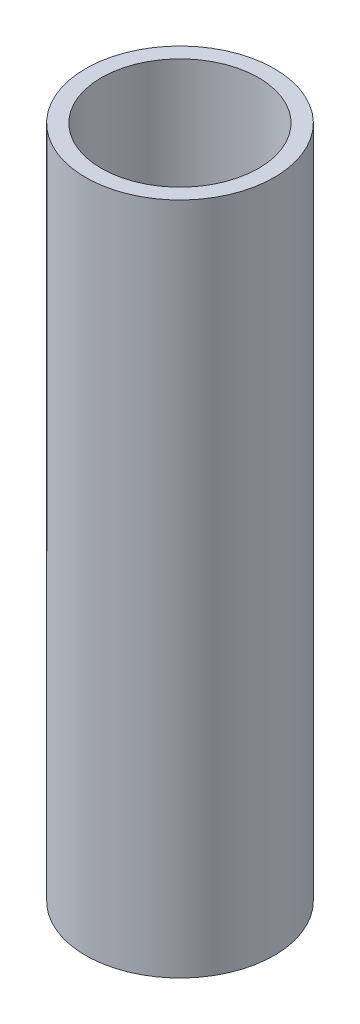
ISO-10303-21;
HEADER;
FILE_DESCRIPTION(('STEP AP214'),'2;1');
FILE_NAME('part.step','',(''),(''),'','','');
FILE_SCHEMA(('AUTOMOTIVE_DESIGN { 1 0 10303 214 1 1 1 1 }'));
ENDSEC;
DATA;
#1=APPLICATION_CONTEXT('core data for automotive mechanical design processes');
#2=APPLICATION_PROTOCOL_DEFINITION('international standard','automotive_design',2000,#1);
#3=PRODUCT_CONTEXT('',#1,'mechanical');
#4=PRODUCT('Part','Part','',(#3));
#5=PRODUCT_RELATED_PRODUCT_CATEGORY('part','',(#4));
#6=PRODUCT_DEFINITION_FORMATION('','',#4);
#7=PRODUCT_DEFINITION_CONTEXT('part definition',#1,'design');
#8=PRODUCT_DEFINITION('design','',#6,#7);
#9=PRODUCT_DEFINITION_SHAPE('','',#8);
#10=(LENGTH_UNIT() NAMED_UNIT(*) SI_UNIT(.MILLI.,.METRE.));
#11=(NAMED_UNIT(*) PLANE_ANGLE_UNIT() SI_UNIT($,.RADIAN.));
#12=(NAMED_UNIT(*) SI_UNIT($,.STERADIAN.) SOLID_ANGLE_UNIT());
#13=UNCERTAINTY_MEASURE_WITH_UNIT(LENGTH_MEASURE(1.E-05),#10,'distance_accuracy_value','');
#14=(GEOMETRIC_REPRESENTATION_CONTEXT(3) GLOBAL_UNCERTAINTY_ASSIGNED_CONTEXT((#13)) GLOBAL_UNIT_ASSIGNED_CONTEXT((#10,
#11,#12)) REPRESENTATION_CONTEXT('',''));
#15=CARTESIAN_POINT('',(0.,0.,0.));
#16=DIRECTION('',(0.,0.,1.));
#17=DIRECTION('',(1.,0.,0.));
#18=AXIS2_PLACEMENT_3D('',#15,#16,#17);
#19=CARTESIAN_POINT('',(0.,90.,0.));
#20=DIRECTION('',(0.,1.,0.));
#21=DIRECTION('',(0.,0.,1.));
#22=AXIS2_PLACEMENT_3D('',#19,#20,#21);
#23=PLANE('',#22);
#24=CARTESIAN_POINT('',(0.,90.,0.));
#25=DIRECTION('',(0.,1.,0.));
#26=DIRECTION('',(0.,0.,1.));
#27=AXIS2_PLACEMENT_3D('',#24,#25,#26);
#28=CIRCLE('',#27,12.6);
#29=CARTESIAN_POINT('',(0.,90.,-12.6));
#30=VERTEX_POINT('',#29);
#31=EDGE_CURVE('E10',#30,#30,#28,.T.);
#32=ORIENTED_EDGE('',*,*,#31,.T.);
#33=EDGE_LOOP('',(#32));
#34=FACE_BOUND('',#33,.T.);
#35=CARTESIAN_POINT('',(0.,90.,0.));
#36=DIRECTION('',(0.,1.,0.));
#37=DIRECTION('',(0.,0.,1.));
#38=AXIS2_PLACEMENT_3D('',#35,#36,#37);
#39=CIRCLE('',#38,10.5);
#40=CARTESIAN_POINT('',(0.,90.,-10.5));
#41=VERTEX_POINT('',#40);
#42=EDGE_CURVE('E42',#41,#41,#39,.T.);
#43=ORIENTED_EDGE('',*,*,#42,.F.);
#44=EDGE_LOOP('',(#43));
#45=FACE_BOUND('',#44,.T.);
#46=ADVANCED_FACE('F31',(#34,#45),#23,.T.);
#47=CARTESIAN_POINT('',(0.,0.,0.));
#48=DIRECTION('',(0.,1.,0.));
#49=DIRECTION('',(0.,0.,1.));
#50=AXIS2_PLACEMENT_3D('',#47,#48,#49);
#51=PLANE('',#50);
#52=CARTESIAN_POINT('',(0.,0.,0.));
#53=DIRECTION('',(0.,1.,0.));
#54=DIRECTION('',(0.,0.,1.));
#55=AXIS2_PLACEMENT_3D('',#52,#53,#54);
#56=CIRCLE('',#55,12.6);
#57=CARTESIAN_POINT('',(0.,0.,-12.6));
#58=VERTEX_POINT('',#57);
#59=EDGE_CURVE('E35',#58,#58,#56,.T.);
#60=ORIENTED_EDGE('',*,*,#59,.F.);
#61=EDGE_LOOP('',(#60));
#62=FACE_BOUND('',#61,.T.);
#63=CARTESIAN_POINT('',(0.,0.,0.));
#64=DIRECTION('',(0.,1.,0.));
#65=DIRECTION('',(0.,0.,1.));
#66=AXIS2_PLACEMENT_3D('',#63,#64,#65);
#67=CIRCLE('',#66,10.5);
#68=CARTESIAN_POINT('',(0.,0.,-10.5));
#69=VERTEX_POINT('',#68);
#70=EDGE_CURVE('E44',#69,#69,#67,.T.);
#71=ORIENTED_EDGE('',*,*,#70,.T.);
#72=EDGE_LOOP('',(#71));
#73=FACE_BOUND('',#72,.T.);
#74=ADVANCED_FACE('F54',(#62,#73),#51,.F.);
#75=CARTESIAN_POINT('',(0.,90.,0.));
#76=DIRECTION('',(0.,-1.,0.));
#77=DIRECTION('',(0.,0.,-1.));
#78=AXIS2_PLACEMENT_3D('',#75,#76,#77);
#79=CYLINDRICAL_SURFACE('',#78,12.6);
#80=CARTESIAN_POINT('',(0.,90.,-12.6));
#81=CARTESIAN_POINT('',(0.,89.0625,-12.6));
#82=CARTESIAN_POINT('',(0.,88.125,-12.6));
#83=CARTESIAN_POINT('',(0.,86.25,-12.6));
#84=CARTESIAN_POINT('',(0.,85.3125,-12.6));
#85=CARTESIAN_POINT('',(0.,83.4375,-12.6));
#86=CARTESIAN_POINT('',(0.,82.5,-12.6));
#87=CARTESIAN_POINT('',(0.,80.625,-12.6));
#88=CARTESIAN_POINT('',(0.,79.6875,-12.6));
#89=CARTESIAN_POINT('',(0.,77.8125,-12.6));
#90=CARTESIAN_POINT('',(0.,76.875,-12.6));
#91=CARTESIAN_POINT('',(0.,75.,-12.6));
#92=CARTESIAN_POINT('',(0.,74.0625,-12.6));
#93=CARTESIAN_POINT('',(0.,72.1875,-12.6));
#94=CARTESIAN_POINT('',(0.,71.25,-12.6));
#95=CARTESIAN_POINT('',(0.,69.375,-12.6));
#96=CARTESIAN_POINT('',(0.,68.4375,-12.6));
#97=CARTESIAN_POINT('',(0.,66.5625,-12.6));
#98=CARTESIAN_POINT('',(0.,65.625,-12.6));
#99=CARTESIAN_POINT('',(0.,63.75,-12.6));
#100=CARTESIAN_POINT('',(0.,62.8125,-12.6));
#101=CARTESIAN_POINT('',(0.,60.9375,-12.6));
#102=CARTESIAN_POINT('',(0.,60.,-12.6));
#103=CARTESIAN_POINT('',(0.,58.125,-12.6));
#104=CARTESIAN_POINT('',(0.,57.1875,-12.6));
#105=CARTESIAN_POINT('',(0.,55.3125,-12.6));
#106=CARTESIAN_POINT('',(0.,54.375,-12.6));
#107=CARTESIAN_POINT('',(0.,52.5,-12.6));
#108=CARTESIAN_POINT('',(0.,51.5625,-12.6));
#109=CARTESIAN_POINT('',(0.,49.6875,-12.6));
#110=CARTESIAN_POINT('',(0.,48.75,-12.6));
#111=CARTESIAN_POINT('',(0.,46.875,-12.6));
#112=CARTESIAN_POINT('',(0.,45.9375,-12.6));
#113=CARTESIAN_POINT('',(0.,44.0625,-12.6));
#114=CARTESIAN_POINT('',(0.,43.125,-12.6));
#115=CARTESIAN_POINT('',(0.,41.25,-12.6));
#116=CARTESIAN_POINT('',(0.,40.3125,-12.6));
#117=CARTESIAN_POINT('',(0.,38.4375,-12.6));
#118=CARTESIAN_POINT('',(0.,37.5,-12.6));
#119=CARTESIAN_POINT('',(0.,35.625,-12.6));
#120=CARTESIAN_POINT('',(0.,34.6875,-12.6));
#121=CARTESIAN_POINT('',(0.,32.8125,-12.6));
#122=CARTESIAN_POINT('',(0.,31.875,-12.6));
#123=CARTESIAN_POINT('',(0.,30.,-12.6));
#124=CARTESIAN_POINT('',(0.,29.0625,-12.6));
#125=CARTESIAN_POINT('',(0.,27.1875,-12.6));
#126=CARTESIAN_POINT('',(0.,26.25,-12.6));
#127=CARTESIAN_POINT('',(0.,24.375,-12.6));
#128=CARTESIAN_POINT('',(0.,23.4375,-12.6));
#129=CARTESIAN_POINT('',(0.,21.5625,-12.6));
#130=CARTESIAN_POINT('',(0.,20.625,-12.6));
#131=CARTESIAN_POINT('',(0.,18.75,-12.6));
#132=CARTESIAN_POINT('',(0.,17.8125,-12.6));
#133=CARTESIAN_POINT('',(0.,15.9375,-12.6));
#134=CARTESIAN_POINT('',(0.,15.,-12.6));
#135=CARTESIAN_POINT('',(0.,13.125,-12.6));
#136=CARTESIAN_POINT('',(0.,12.1875,-12.6));
#137=CARTESIAN_POINT('',(0.,10.3125,-12.6));
#138=CARTESIAN_POINT('',(0.,9.37499999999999,-12.6));
#139=CARTESIAN_POINT('',(0.,7.49999999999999,-12.6));
#140=CARTESIAN_POINT('',(0.,6.56249999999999,-12.6));
#141=CARTESIAN_POINT('',(0.,4.68749999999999,-12.6));
#142=CARTESIAN_POINT('',(0.,3.74999999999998,-12.6));
#143=CARTESIAN_POINT('',(0.,1.87499999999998,-12.6));
#144=CARTESIAN_POINT('',(0.,0.937499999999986,-12.6));
#145=CARTESIAN_POINT('',(0.,0.,-12.6));
#146=B_SPLINE_CURVE_WITH_KNOTS('',3,(#80,#81,#82,#83,#84,#85,#86,#87,#88,#89,#90,#91,#92,#93,
#94,#95,#96,#97,#98,#99,#100,#101,#102,#103,#104,#105,#106,#107,#108,#109,#110,#111,#112,#113,
#114,#115,#116,#117,#118,#119,#120,#121,#122,#123,#124,#125,#126,#127,#128,#129,#130,#131,#132,
#133,#134,#135,#136,#137,#138,#139,#140,#141,#142,#143,#144,#145),.UNSPECIFIED.,.F.,.F.,(4,2,2,
2,2,2,2,2,2,2,2,2,2,2,2,2,2,2,2,2,2,2,2,2,2,2,2,2,2,2,2,2,4),(0.,2.8125,5.62499999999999,
8.43749999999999,11.25,14.0625,16.875,19.6875,22.5,25.3125,28.125,30.9375,33.75,36.5625,39.375,
42.1875,45.,47.8125,50.625,53.4375,56.25,59.0625,61.875,64.6875,67.5,70.3125,73.125,75.9375,
78.75,81.5625,84.375,87.1875,90.),.UNSPECIFIED.);
#147=EDGE_CURVE('BSEAM33',#30,#58,#146,.T.);
#148=ORIENTED_EDGE('',*,*,#31,.F.);
#149=ORIENTED_EDGE('',*,*,#59,.T.);
#150=ORIENTED_EDGE('',*,*,#147,.T.);
#151=ORIENTED_EDGE('',*,*,#147,.F.);
#152=EDGE_LOOP('',(#148,#150,#149,#151));
#153=FACE_BOUND('',#152,.T.);
#154=ADVANCED_FACE('F33',(#153),#79,.T.);
#155=CARTESIAN_POINT('',(0.,90.,0.));
#156=DIRECTION('',(0.,-1.,0.));
#157=DIRECTION('',(0.,0.,-1.));
#158=AXIS2_PLACEMENT_3D('',#155,#156,#157);
#159=CYLINDRICAL_SURFACE('',#158,10.5);
#160=CARTESIAN_POINT('',(0.,90.,-10.5));
#161=CARTESIAN_POINT('',(0.,89.0625,-10.5));
#162=CARTESIAN_POINT('',(0.,88.125,-10.5));
#163=CARTESIAN_POINT('',(0.,86.25,-10.5));
#164=CARTESIAN_POINT('',(0.,85.3125,-10.5));
#165=CARTESIAN_POINT('',(0.,83.4375,-10.5));
#166=CARTESIAN_POINT('',(0.,82.5,-10.5));
#167=CARTESIAN_POINT('',(0.,80.625,-10.5));
#168=CARTESIAN_POINT('',(0.,79.6875,-10.5));
#169=CARTESIAN_POINT('',(0.,77.8125,-10.5));
#170=CARTESIAN_POINT('',(0.,76.875,-10.5));
#171=CARTESIAN_POINT('',(0.,75.,-10.5));
#172=CARTESIAN_POINT('',(0.,74.0625,-10.5));
#173=CARTESIAN_POINT('',(0.,72.1875,-10.5));
#174=CARTESIAN_POINT('',(0.,71.25,-10.5));
#175=CARTESIAN_POINT('',(0.,69.375,-10.5));
#176=CARTESIAN_POINT('',(0.,68.4375,-10.5));
#177=CARTESIAN_POINT('',(0.,66.5625,-10.5));
#178=CARTESIAN_POINT('',(0.,65.625,-10.5));
#179=CARTESIAN_POINT('',(0.,63.75,-10.5));
#180=CARTESIAN_POINT('',(0.,62.8125,-10.5));
#181=CARTESIAN_POINT('',(0.,60.9375,-10.5));
#182=CARTESIAN_POINT('',(0.,60.,-10.5));
#183=CARTESIAN_POINT('',(0.,58.125,-10.5));
#184=CARTESIAN_POINT('',(0.,57.1875,-10.5));
#185=CARTESIAN_POINT('',(0.,55.3125,-10.5));
#186=CARTESIAN_POINT('',(0.,54.375,-10.5));
#187=CARTESIAN_POINT('',(0.,52.5,-10.5));
#188=CARTESIAN_POINT('',(0.,51.5625,-10.5));
#189=CARTESIAN_POINT('',(0.,49.6875,-10.5));
#190=CARTESIAN_POINT('',(0.,48.75,-10.5));
#191=CARTESIAN_POINT('',(0.,46.875,-10.5));
#192=CARTESIAN_POINT('',(0.,45.9375,-10.5));
#193=CARTESIAN_POINT('',(0.,44.0625,-10.5));
#194=CARTESIAN_POINT('',(0.,43.125,-10.5));
#195=CARTESIAN_POINT('',(0.,41.25,-10.5));
#196=CARTESIAN_POINT('',(0.,40.3125,-10.5));
#197=CARTESIAN_POINT('',(0.,38.4375,-10.5));
#198=CARTESIAN_POINT('',(0.,37.5,-10.5));
#199=CARTESIAN_POINT('',(0.,35.625,-10.5));
#200=CARTESIAN_POINT('',(0.,34.6875,-10.5));
#201=CARTESIAN_POINT('',(0.,32.8125,-10.5));
#202=CARTESIAN_POINT('',(0.,31.875,-10.5));
#203=CARTESIAN_POINT('',(0.,30.,-10.5));
#204=CARTESIAN_POINT('',(0.,29.0625,-10.5));
#205=CARTESIAN_POINT('',(0.,27.1875,-10.5));
#206=CARTESIAN_POINT('',(0.,26.25,-10.5));
#207=CARTESIAN_POINT('',(0.,24.375,-10.5));
#208=CARTESIAN_POINT('',(0.,23.4375,-10.5));
#209=CARTESIAN_POINT('',(0.,21.5625,-10.5));
#210=CARTESIAN_POINT('',(0.,20.625,-10.5));
#211=CARTESIAN_POINT('',(0.,18.75,-10.5));
#212=CARTESIAN_POINT('',(0.,17.8125,-10.5));
#213=CARTESIAN_POINT('',(0.,15.9375,-10.5));
#214=CARTESIAN_POINT('',(0.,15.,-10.5));
#215=CARTESIAN_POINT('',(0.,13.125,-10.5));
#216=CARTESIAN_POINT('',(0.,12.1875,-10.5));
#217=CARTESIAN_POINT('',(0.,10.3125,-10.5));
#218=CARTESIAN_POINT('',(0.,9.37499999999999,-10.5));
#219=CARTESIAN_POINT('',(0.,7.49999999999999,-10.5));
#220=CARTESIAN_POINT('',(0.,6.56249999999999,-10.5));
#221=CARTESIAN_POINT('',(0.,4.68749999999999,-10.5));
#222=CARTESIAN_POINT('',(0.,3.74999999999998,-10.5));
#223=CARTESIAN_POINT('',(0.,1.87499999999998,-10.5));
#224=CARTESIAN_POINT('',(0.,0.937499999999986,-10.5));
#225=CARTESIAN_POINT('',(0.,0.,-10.5));
#226=B_SPLINE_CURVE_WITH_KNOTS('',3,(#160,#161,#162,#163,#164,#165,#166,#167,#168,#169,#170,
#171,#172,#173,#174,#175,#176,#177,#178,#179,#180,#181,#182,#183,#184,#185,#186,#187,#188,#189,
#190,#191,#192,#193,#194,#195,#196,#197,#198,#199,#200,#201,#202,#203,#204,#205,#206,#207,#208,
#209,#210,#211,#212,#213,#214,#215,#216,#217,#218,#219,#220,#221,#222,#223,#224,#225),
.UNSPECIFIED.,.F.,.F.,(4,2,2,2,2,2,2,2,2,2,2,2,2,2,2,2,2,2,2,2,2,2,2,2,2,2,2,2,2,2,2,2,4),(0.,
2.81250000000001,5.62500000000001,8.43750000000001,11.25,14.0625,16.875,19.6875,22.5,25.3125,
28.125,30.9375,33.75,36.5625,39.375,42.1875,45.,47.8125,50.625,53.4375,56.25,59.0625,61.875,
64.6875,67.5,70.3125,73.125,75.9375,78.75,81.5625,84.375,87.1875,90.),.UNSPECIFIED.);
#227=EDGE_CURVE('BSEAM50',#41,#69,#226,.T.);
#228=ORIENTED_EDGE('',*,*,#42,.T.);
#229=ORIENTED_EDGE('',*,*,#70,.F.);
#230=ORIENTED_EDGE('',*,*,#227,.T.);
#231=ORIENTED_EDGE('',*,*,#227,.F.);
#232=EDGE_LOOP('',(#228,#230,#229,#231));
#233=FACE_BOUND('',#232,.T.);
#234=ADVANCED_FACE('F50',(#233),#159,.F.);
#235=CLOSED_SHELL('',(#46,#74,#154,#234));
#236=MANIFOLD_SOLID_BREP('B2',#235);
#237=ADVANCED_BREP_SHAPE_REPRESENTATION('',(#18,#236),#14);
#238=SHAPE_DEFINITION_REPRESENTATION(#9,#237);
ENDSEC;
END-ISO-10303-21;
